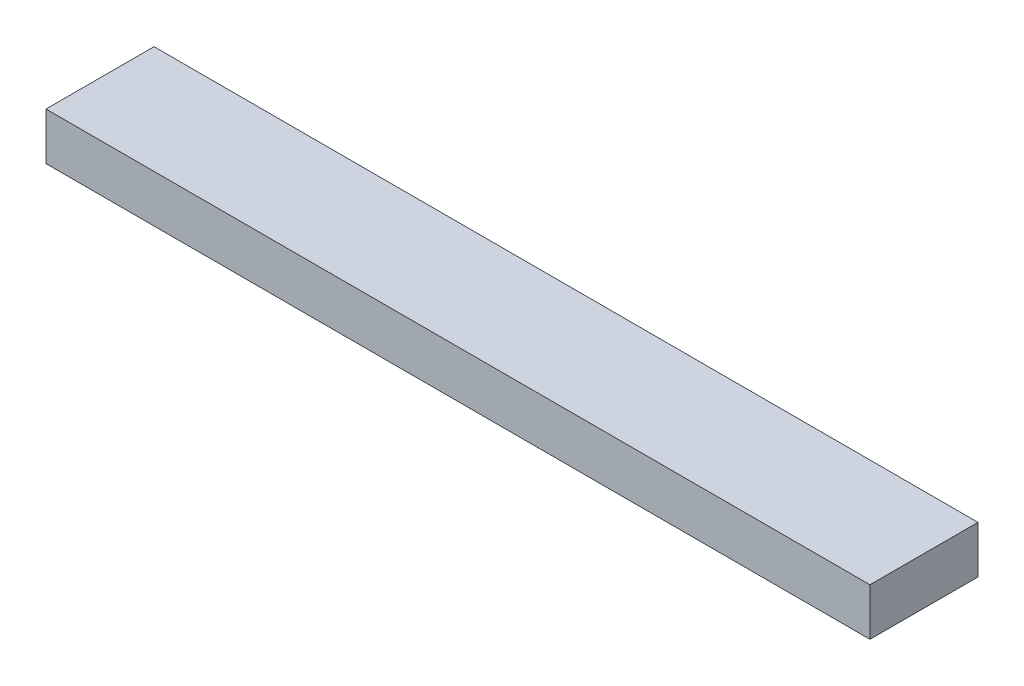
ISO-10303-21;
HEADER;
FILE_DESCRIPTION(('STEP AP214'),'2;1');
FILE_NAME('part.step','',(''),(''),'','','');
FILE_SCHEMA(('AUTOMOTIVE_DESIGN { 1 0 10303 214 1 1 1 1 }'));
ENDSEC;
DATA;
#1=APPLICATION_CONTEXT('core data for automotive mechanical design processes');
#2=APPLICATION_PROTOCOL_DEFINITION('international standard','automotive_design',2000,#1);
#3=PRODUCT_CONTEXT('',#1,'mechanical');
#4=PRODUCT('Part','Part','',(#3));
#5=PRODUCT_RELATED_PRODUCT_CATEGORY('part','',(#4));
#6=PRODUCT_DEFINITION_FORMATION('','',#4);
#7=PRODUCT_DEFINITION_CONTEXT('part definition',#1,'design');
#8=PRODUCT_DEFINITION('design','',#6,#7);
#9=PRODUCT_DEFINITION_SHAPE('','',#8);
#10=(LENGTH_UNIT() NAMED_UNIT(*) SI_UNIT(.MILLI.,.METRE.));
#11=(NAMED_UNIT(*) PLANE_ANGLE_UNIT() SI_UNIT($,.RADIAN.));
#12=(NAMED_UNIT(*) SI_UNIT($,.STERADIAN.) SOLID_ANGLE_UNIT());
#13=UNCERTAINTY_MEASURE_WITH_UNIT(LENGTH_MEASURE(1.E-05),#10,'distance_accuracy_value','');
#14=(GEOMETRIC_REPRESENTATION_CONTEXT(3) GLOBAL_UNCERTAINTY_ASSIGNED_CONTEXT((#13)) GLOBAL_UNIT_ASSIGNED_CONTEXT((#10,
#11,#12)) REPRESENTATION_CONTEXT('',''));
#15=CARTESIAN_POINT('',(0.,0.,0.));
#16=DIRECTION('',(0.,0.,1.));
#17=DIRECTION('',(1.,0.,0.));
#18=AXIS2_PLACEMENT_3D('',#15,#16,#17);
#19=CARTESIAN_POINT('',(0.,0.,8.));
#20=DIRECTION('',(0.,0.,1.));
#21=DIRECTION('',(1.,0.,0.));
#22=AXIS2_PLACEMENT_3D('',#19,#20,#21);
#23=PLANE('',#22);
#24=DIRECTION('',(-1.,0.,0.));
#25=VECTOR('',#24,1.);
#26=CARTESIAN_POINT('',(0.,-3.5,8.));
#27=LINE('',#26,#25);
#28=CARTESIAN_POINT('',(61.,-3.5,8.));
#29=VERTEX_POINT('',#28);
#30=CARTESIAN_POINT('',(-61.,-3.5,8.));
#31=VERTEX_POINT('',#30);
#32=EDGE_CURVE('E11',#29,#31,#27,.T.);
#33=ORIENTED_EDGE('',*,*,#32,.F.);
#34=DIRECTION('',(0.,-1.,0.));
#35=VECTOR('',#34,1.);
#36=CARTESIAN_POINT('',(61.,0.,8.));
#37=LINE('',#36,#35);
#38=CARTESIAN_POINT('',(61.,3.5,8.));
#39=VERTEX_POINT('',#38);
#40=EDGE_CURVE('E61',#39,#29,#37,.T.);
#41=ORIENTED_EDGE('',*,*,#40,.F.);
#42=DIRECTION('',(1.,0.,0.));
#43=VECTOR('',#42,1.);
#44=CARTESIAN_POINT('',(0.,3.5,8.));
#45=LINE('',#44,#43);
#46=CARTESIAN_POINT('',(-61.,3.5,8.));
#47=VERTEX_POINT('',#46);
#48=EDGE_CURVE('E87',#47,#39,#45,.T.);
#49=ORIENTED_EDGE('',*,*,#48,.F.);
#50=DIRECTION('',(0.,1.,0.));
#51=VECTOR('',#50,1.);
#52=CARTESIAN_POINT('',(-61.,0.,8.));
#53=LINE('',#52,#51);
#54=EDGE_CURVE('E24',#31,#47,#53,.T.);
#55=ORIENTED_EDGE('',*,*,#54,.F.);
#56=EDGE_LOOP('',(#33,#41,#49,#55));
#57=FACE_BOUND('',#56,.T.);
#58=ADVANCED_FACE('F17',(#57),#23,.T.);
#59=CARTESIAN_POINT('',(0.,-3.5,-8.));
#60=DIRECTION('',(0.,-1.,0.));
#61=DIRECTION('',(0.,0.,-1.));
#62=AXIS2_PLACEMENT_3D('',#59,#60,#61);
#63=PLANE('',#62);
#64=DIRECTION('',(0.,0.,1.));
#65=VECTOR('',#64,1.);
#66=CARTESIAN_POINT('',(61.,-3.5,-8.));
#67=LINE('',#66,#65);
#68=CARTESIAN_POINT('',(61.,-3.5,-8.));
#69=VERTEX_POINT('',#68);
#70=EDGE_CURVE('E53',#69,#29,#67,.T.);
#71=ORIENTED_EDGE('',*,*,#70,.T.);
#72=ORIENTED_EDGE('',*,*,#32,.T.);
#73=DIRECTION('',(0.,0.,1.));
#74=VECTOR('',#73,1.);
#75=CARTESIAN_POINT('',(-61.,-3.5,-8.));
#76=LINE('',#75,#74);
#77=CARTESIAN_POINT('',(-61.,-3.5,-8.));
#78=VERTEX_POINT('',#77);
#79=EDGE_CURVE('E70',#78,#31,#76,.T.);
#80=ORIENTED_EDGE('',*,*,#79,.F.);
#81=DIRECTION('',(1.,0.,0.));
#82=VECTOR('',#81,1.);
#83=CARTESIAN_POINT('',(0.,-3.5,-8.));
#84=LINE('',#83,#82);
#85=EDGE_CURVE('E65',#78,#69,#84,.T.);
#86=ORIENTED_EDGE('',*,*,#85,.T.);
#87=EDGE_LOOP('',(#71,#72,#80,#86));
#88=FACE_BOUND('',#87,.T.);
#89=ADVANCED_FACE('F66',(#88),#63,.T.);
#90=CARTESIAN_POINT('',(-61.,0.,-8.));
#91=DIRECTION('',(-1.,0.,0.));
#92=DIRECTION('',(0.,0.,1.));
#93=AXIS2_PLACEMENT_3D('',#90,#91,#92);
#94=PLANE('',#93);
#95=ORIENTED_EDGE('',*,*,#79,.T.);
#96=ORIENTED_EDGE('',*,*,#54,.T.);
#97=DIRECTION('',(0.,0.,1.));
#98=VECTOR('',#97,1.);
#99=CARTESIAN_POINT('',(-61.,3.5,-8.));
#100=LINE('',#99,#98);
#101=CARTESIAN_POINT('',(-61.,3.5,-8.));
#102=VERTEX_POINT('',#101);
#103=EDGE_CURVE('E85',#102,#47,#100,.T.);
#104=ORIENTED_EDGE('',*,*,#103,.F.);
#105=DIRECTION('',(0.,-1.,0.));
#106=VECTOR('',#105,1.);
#107=CARTESIAN_POINT('',(-61.,0.,-8.));
#108=LINE('',#107,#106);
#109=EDGE_CURVE('E75',#102,#78,#108,.T.);
#110=ORIENTED_EDGE('',*,*,#109,.T.);
#111=EDGE_LOOP('',(#95,#96,#104,#110));
#112=FACE_BOUND('',#111,.T.);
#113=ADVANCED_FACE('F93',(#112),#94,.T.);
#114=CARTESIAN_POINT('',(0.,3.5,-8.));
#115=DIRECTION('',(0.,1.,0.));
#116=DIRECTION('',(0.,0.,1.));
#117=AXIS2_PLACEMENT_3D('',#114,#115,#116);
#118=PLANE('',#117);
#119=ORIENTED_EDGE('',*,*,#103,.T.);
#120=ORIENTED_EDGE('',*,*,#48,.T.);
#121=DIRECTION('',(0.,0.,1.));
#122=VECTOR('',#121,1.);
#123=CARTESIAN_POINT('',(61.,3.5,-8.));
#124=LINE('',#123,#122);
#125=CARTESIAN_POINT('',(61.,3.5,-8.));
#126=VERTEX_POINT('',#125);
#127=EDGE_CURVE('E62',#126,#39,#124,.T.);
#128=ORIENTED_EDGE('',*,*,#127,.F.);
#129=DIRECTION('',(-1.,0.,0.));
#130=VECTOR('',#129,1.);
#131=CARTESIAN_POINT('',(0.,3.5,-8.));
#132=LINE('',#131,#130);
#133=EDGE_CURVE('E76',#126,#102,#132,.T.);
#134=ORIENTED_EDGE('',*,*,#133,.T.);
#135=EDGE_LOOP('',(#119,#120,#128,#134));
#136=FACE_BOUND('',#135,.T.);
#137=ADVANCED_FACE('F90',(#136),#118,.T.);
#138=CARTESIAN_POINT('',(0.,0.,-8.));
#139=DIRECTION('',(0.,0.,-1.));
#140=DIRECTION('',(-1.,0.,0.));
#141=AXIS2_PLACEMENT_3D('',#138,#139,#140);
#142=PLANE('',#141);
#143=DIRECTION('',(0.,1.,0.));
#144=VECTOR('',#143,1.);
#145=CARTESIAN_POINT('',(61.,0.,-8.));
#146=LINE('',#145,#144);
#147=EDGE_CURVE('E56',#69,#126,#146,.T.);
#148=ORIENTED_EDGE('',*,*,#147,.F.);
#149=ORIENTED_EDGE('',*,*,#85,.F.);
#150=ORIENTED_EDGE('',*,*,#109,.F.);
#151=ORIENTED_EDGE('',*,*,#133,.F.);
#152=EDGE_LOOP('',(#148,#149,#150,#151));
#153=FACE_BOUND('',#152,.T.);
#154=ADVANCED_FACE('F72',(#153),#142,.T.);
#155=CARTESIAN_POINT('',(61.,0.,-8.));
#156=DIRECTION('',(1.,0.,0.));
#157=DIRECTION('',(0.,0.,-1.));
#158=AXIS2_PLACEMENT_3D('',#155,#156,#157);
#159=PLANE('',#158);
#160=ORIENTED_EDGE('',*,*,#147,.T.);
#161=ORIENTED_EDGE('',*,*,#127,.T.);
#162=ORIENTED_EDGE('',*,*,#40,.T.);
#163=ORIENTED_EDGE('',*,*,#70,.F.);
#164=EDGE_LOOP('',(#160,#161,#162,#163));
#165=FACE_BOUND('',#164,.T.);
#166=ADVANCED_FACE('F57',(#165),#159,.T.);
#167=CLOSED_SHELL('',(#58,#89,#113,#137,#154,#166));
#168=MANIFOLD_SOLID_BREP('B1',#167);
#169=ADVANCED_BREP_SHAPE_REPRESENTATION('',(#18,#168),#14);
#170=SHAPE_DEFINITION_REPRESENTATION(#9,#169);
ENDSEC;
END-ISO-10303-21;
